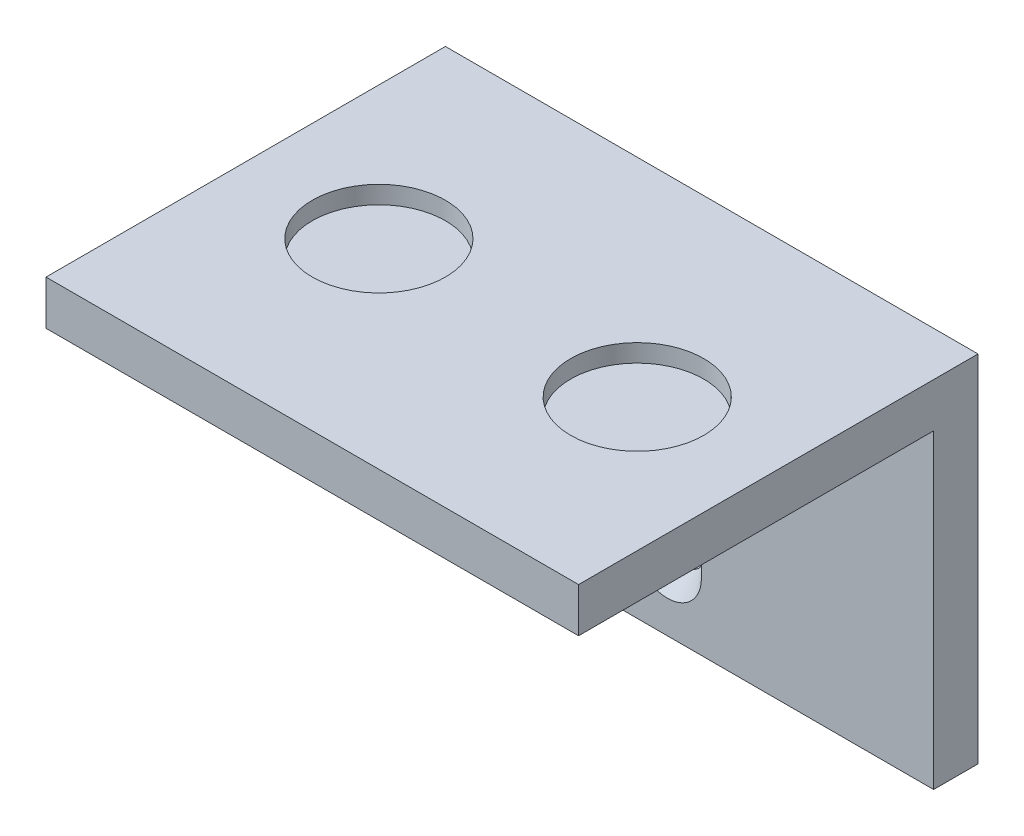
from build123d import *

# Parameters (mm, degrees)
SKETCH1_W           = 152.4
SKETCH1_H           = 101.6
BOSS_EXTRUDE1_DEPTH = 12.7
SKETCH3_W           = 152.4
SKETCH3_H           = 12.7
BOSS_EXTRUDE2_DEPTH = 101.6
SKETCH20_R          = 19.05
CUT_EXTRUDE3_DEPTH  = 5.08
CUT_EXTRUDE4_DEPTH  = 216.9
CHAMFER1_SIZE       = 4.9149
CHAMFER1_SIZE2      = 5.653945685


with BuildPart() as part:
    # Sketch1 → Boss-Extrude1 (new body)
    with BuildSketch(Plane.XY):
        with Locations((76.2, 50.8)):
            Rectangle(SKETCH1_W, SKETCH1_H)
    extrude(amount=BOSS_EXTRUDE1_DEPTH)

    # Sketch3 → Boss-Extrude2 (add)
    with BuildSketch(Plane.XY.offset(12.7)):
        with Locations((76.2, 95.25)):
            Rectangle(SKETCH3_W, SKETCH3_H)
    extrude(amount=BOSS_EXTRUDE2_DEPTH)

    # Sketch20 → Cut-Extrude3 (cut)
    with BuildSketch(Plane(origin=(0, 101.6, 0), x_dir=(1, 0, 0), z_dir=(0, 1, 0))):
        with Locations(Location((38.1, -57.15, 0), (0, 0, 270))):
            Circle(SKETCH20_R)
        with Locations(Location((114.3, -59.417452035, 0), (0, 0, 270))):
            Circle(SKETCH20_R)
    extrude(amount=-CUT_EXTRUDE3_DEPTH, mode=Mode.SUBTRACT)

    # Sketch27 → Cut-Extrude4 (cut, through all)
    with BuildSketch(Plane.XY):
        with BuildLine():
            Line((71.374, 59.89), (71.374, 19.050000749))
            ThreePointArc((71.374, 19.050000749), (76.2, 14.224), (81.026, 19.050000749))
            Line((81.026, 19.050000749), (81.026, 59.89))
            ThreePointArc((81.026, 59.89), (76.2, 64.716), (71.374, 59.89))
        make_face()
    extrude(amount=CUT_EXTRUDE4_DEPTH, mode=Mode.SUBTRACT)

    # Chamfer1
    chamfer1_edges = [part.edges().sort_by_distance(p)[0] for p in [
        (81.026, 39.470000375, 12.7),
        (71.374, 39.470000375, 12.7),
        (76.2, 14.224, 12.7),
        (76.2, 64.716, 12.7),
    ]]
    chamfer1_side = [part.faces().sort_by_distance(p)[0] for p in [
        (1.764340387, 44.45, 12.7),
    ]]
    chamfer(chamfer1_edges, length=CHAMFER1_SIZE, length2=CHAMFER1_SIZE2, reference=chamfer1_side[0])


solid = part.part
